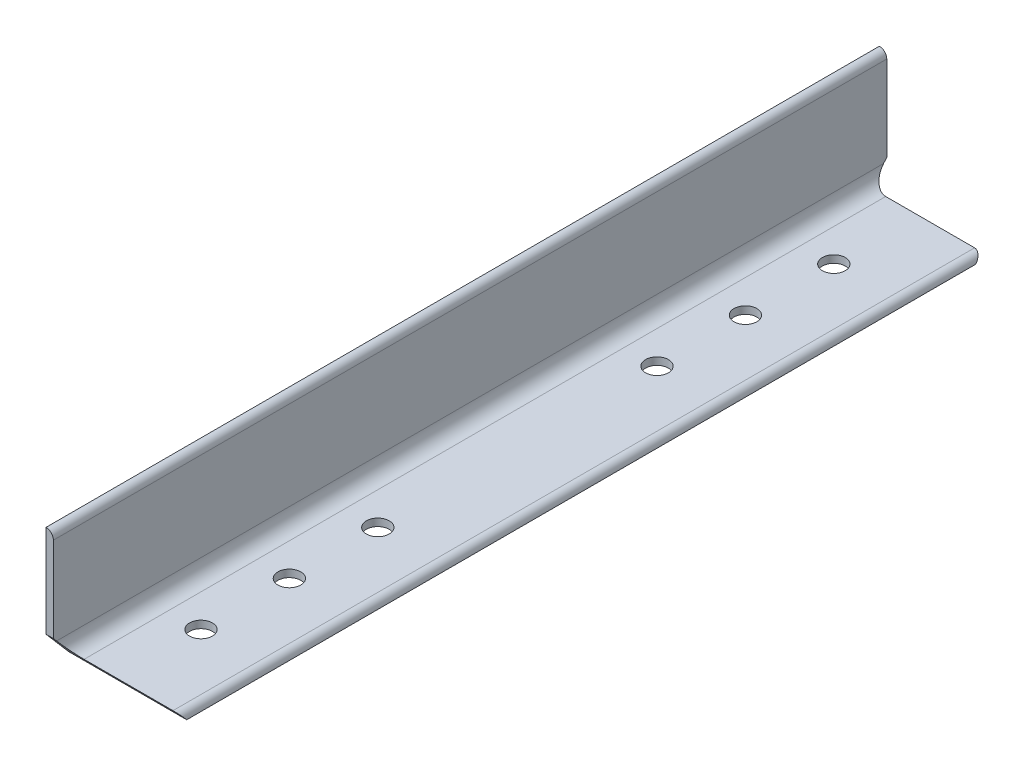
ISO-10303-21;
HEADER;
FILE_DESCRIPTION(('STEP AP214'),'2;1');
FILE_NAME('part.step','',(''),(''),'','','');
FILE_SCHEMA(('AUTOMOTIVE_DESIGN { 1 0 10303 214 1 1 1 1 }'));
ENDSEC;
DATA;
#1=APPLICATION_CONTEXT('core data for automotive mechanical design processes');
#2=APPLICATION_PROTOCOL_DEFINITION('international standard','automotive_design',2000,#1);
#3=PRODUCT_CONTEXT('',#1,'mechanical');
#4=PRODUCT('Part','Part','',(#3));
#5=PRODUCT_RELATED_PRODUCT_CATEGORY('part','',(#4));
#6=PRODUCT_DEFINITION_FORMATION('','',#4);
#7=PRODUCT_DEFINITION_CONTEXT('part definition',#1,'design');
#8=PRODUCT_DEFINITION('design','',#6,#7);
#9=PRODUCT_DEFINITION_SHAPE('','',#8);
#10=(LENGTH_UNIT() NAMED_UNIT(*) SI_UNIT(.MILLI.,.METRE.));
#11=(NAMED_UNIT(*) PLANE_ANGLE_UNIT() SI_UNIT($,.RADIAN.));
#12=(NAMED_UNIT(*) SI_UNIT($,.STERADIAN.) SOLID_ANGLE_UNIT());
#13=UNCERTAINTY_MEASURE_WITH_UNIT(LENGTH_MEASURE(1.E-05),#10,'distance_accuracy_value','');
#14=(GEOMETRIC_REPRESENTATION_CONTEXT(3) GLOBAL_UNCERTAINTY_ASSIGNED_CONTEXT((#13)) GLOBAL_UNIT_ASSIGNED_CONTEXT((#10,
#11,#12)) REPRESENTATION_CONTEXT('',''));
#15=CARTESIAN_POINT('',(0.,0.,0.));
#16=DIRECTION('',(0.,0.,1.));
#17=DIRECTION('',(1.,0.,0.));
#18=AXIS2_PLACEMENT_3D('',#15,#16,#17);
#19=CARTESIAN_POINT('',(37.3445567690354,-13.455443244,357.74569675));
#20=DIRECTION('',(0.,1.,0.));
#21=DIRECTION('',(-1.,0.,0.));
#22=AXIS2_PLACEMENT_3D('',#19,#20,#21);
#23=PLANE('',#22);
#24=CARTESIAN_POINT('',(10.0446367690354,-13.455443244,314.56569675));
#25=DIRECTION('',(0.,1.,0.));
#26=DIRECTION('',(0.,0.,1.));
#27=AXIS2_PLACEMENT_3D('',#24,#25,#26);
#28=CIRCLE('',#27,4.90220000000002);
#29=CARTESIAN_POINT('',(10.0446367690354,-13.455443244,319.46789675));
#30=VERTEX_POINT('',#29);
#31=EDGE_CURVE('E168',#30,#30,#28,.T.);
#32=ORIENTED_EDGE('',*,*,#31,.T.);
#33=EDGE_LOOP('',(#32));
#34=FACE_BOUND('',#33,.T.);
#35=CARTESIAN_POINT('',(10.0446367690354,-13.455443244,119.075199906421));
#36=DIRECTION('',(0.,1.,0.));
#37=DIRECTION('',(0.,0.,1.));
#38=AXIS2_PLACEMENT_3D('',#35,#36,#37);
#39=CIRCLE('',#38,4.90219999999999);
#40=CARTESIAN_POINT('',(10.0446367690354,-13.455443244,123.977399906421));
#41=VERTEX_POINT('',#40);
#42=EDGE_CURVE('E223',#41,#41,#39,.T.);
#43=ORIENTED_EDGE('',*,*,#42,.T.);
#44=EDGE_LOOP('',(#43));
#45=FACE_BOUND('',#44,.T.);
#46=CARTESIAN_POINT('',(10.0446367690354,-13.455443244,81.1757262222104));
#47=DIRECTION('',(0.,1.,0.));
#48=DIRECTION('',(0.,0.,1.));
#49=AXIS2_PLACEMENT_3D('',#46,#47,#48);
#50=CIRCLE('',#49,4.90219999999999);
#51=CARTESIAN_POINT('',(10.0446367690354,-13.455443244,86.0779262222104));
#52=VERTEX_POINT('',#51);
#53=EDGE_CURVE('E194',#52,#52,#50,.T.);
#54=ORIENTED_EDGE('',*,*,#53,.T.);
#55=EDGE_LOOP('',(#54));
#56=FACE_BOUND('',#55,.T.);
#57=CARTESIAN_POINT('',(10.0446367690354,-13.455443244,43.276252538));
#58=DIRECTION('',(0.,1.,0.));
#59=DIRECTION('',(0.,0.,1.));
#60=AXIS2_PLACEMENT_3D('',#57,#58,#59);
#61=CIRCLE('',#60,4.9022);
#62=CARTESIAN_POINT('',(10.0446367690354,-13.455443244,48.178452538));
#63=VERTEX_POINT('',#62);
#64=EDGE_CURVE('E233',#63,#63,#61,.T.);
#65=ORIENTED_EDGE('',*,*,#64,.T.);
#66=EDGE_LOOP('',(#65));
#67=FACE_BOUND('',#66,.T.);
#68=CARTESIAN_POINT('',(10.0446367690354,-13.455443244,238.766749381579));
#69=DIRECTION('',(0.,1.,0.));
#70=DIRECTION('',(0.,0.,1.));
#71=AXIS2_PLACEMENT_3D('',#68,#69,#70);
#72=CIRCLE('',#71,4.90220000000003);
#73=CARTESIAN_POINT('',(10.0446367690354,-13.455443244,243.668949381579));
#74=VERTEX_POINT('',#73);
#75=EDGE_CURVE('E231',#74,#74,#72,.T.);
#76=ORIENTED_EDGE('',*,*,#75,.T.);
#77=EDGE_LOOP('',(#76));
#78=FACE_BOUND('',#77,.T.);
#79=CARTESIAN_POINT('',(10.0446367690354,-13.455443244,276.66622306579));
#80=DIRECTION('',(0.,1.,0.));
#81=DIRECTION('',(0.,0.,1.));
#82=AXIS2_PLACEMENT_3D('',#79,#80,#81);
#83=CIRCLE('',#82,4.90220000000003);
#84=CARTESIAN_POINT('',(10.0446367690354,-13.455443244,281.56842306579));
#85=VERTEX_POINT('',#84);
#86=EDGE_CURVE('E226',#85,#85,#83,.T.);
#87=ORIENTED_EDGE('',*,*,#86,.T.);
#88=EDGE_LOOP('',(#87));
#89=FACE_BOUND('',#88,.T.);
#90=DIRECTION('',(0.,0.,-1.));
#91=VECTOR('',#90,1.);
#92=CARTESIAN_POINT('',(-13.4554432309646,-13.455443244,357.74569675));
#93=LINE('',#92,#91);
#94=CARTESIAN_POINT('',(-13.4554432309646,-13.455443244,347.96669675));
#95=VERTEX_POINT('',#94);
#96=CARTESIAN_POINT('',(-13.4554432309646,-13.455443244,9.77899999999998));
#97=VERTEX_POINT('',#96);
#98=EDGE_CURVE('E181',#95,#97,#93,.T.);
#99=ORIENTED_EDGE('',*,*,#98,.T.);
#100=DIRECTION('',(1.,0.,0.));
#101=VECTOR('',#100,1.);
#102=CARTESIAN_POINT('',(37.3445567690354,-13.455443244,9.77899999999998));
#103=LINE('',#102,#101);
#104=CARTESIAN_POINT('',(37.3445567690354,-13.455443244,9.77899999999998));
#105=VERTEX_POINT('',#104);
#106=EDGE_CURVE('E136',#97,#105,#103,.T.);
#107=ORIENTED_EDGE('',*,*,#106,.T.);
#108=DIRECTION('',(0.,0.,-1.));
#109=VECTOR('',#108,1.);
#110=CARTESIAN_POINT('',(37.3445567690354,-13.455443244,357.74569675));
#111=LINE('',#110,#109);
#112=CARTESIAN_POINT('',(37.3445567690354,-13.455443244,347.96669675));
#113=VERTEX_POINT('',#112);
#114=EDGE_CURVE('E11',#113,#105,#111,.T.);
#115=ORIENTED_EDGE('',*,*,#114,.F.);
#116=DIRECTION('',(-1.,0.,0.));
#117=VECTOR('',#116,1.);
#118=CARTESIAN_POINT('',(37.3445567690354,-13.455443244,347.96669675));
#119=LINE('',#118,#117);
#120=EDGE_CURVE('E464',#113,#95,#119,.T.);
#121=ORIENTED_EDGE('',*,*,#120,.T.);
#122=EDGE_LOOP('',(#99,#107,#115,#121));
#123=FACE_BOUND('',#122,.T.);
#124=ADVANCED_FACE('F35',(#34,#45,#56,#67,#78,#89,#123),#23,.F.);
#125=CARTESIAN_POINT('',(37.3445567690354,-13.450363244,357.74569675));
#126=DIRECTION('',(-1.,0.,0.));
#127=DIRECTION('',(0.,0.,1.));
#128=AXIS2_PLACEMENT_3D('',#125,#126,#127);
#129=PLANE('',#128);
#130=ORIENTED_EDGE('',*,*,#114,.T.);
#131=DIRECTION('',(0.,-1.,0.));
#132=VECTOR('',#131,1.);
#133=CARTESIAN_POINT('',(37.3445567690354,-31.3929101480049,9.779));
#134=LINE('',#133,#132);
#135=CARTESIAN_POINT('',(37.3445567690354,-13.450363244,9.77899999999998));
#136=VERTEX_POINT('',#135);
#137=EDGE_CURVE('E141',#136,#105,#134,.T.);
#138=ORIENTED_EDGE('',*,*,#137,.F.);
#139=DIRECTION('',(0.,0.,-1.));
#140=VECTOR('',#139,1.);
#141=CARTESIAN_POINT('',(37.3445567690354,-13.450363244,357.74569675));
#142=LINE('',#141,#140);
#143=CARTESIAN_POINT('',(37.3445567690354,-13.450363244,347.96669675));
#144=VERTEX_POINT('',#143);
#145=EDGE_CURVE('E43',#144,#136,#142,.T.);
#146=ORIENTED_EDGE('',*,*,#145,.F.);
#147=DIRECTION('',(0.,1.,0.));
#148=VECTOR('',#147,1.);
#149=CARTESIAN_POINT('',(37.3445567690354,-24.0856653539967,347.96669675));
#150=LINE('',#149,#148);
#151=EDGE_CURVE('E497',#113,#144,#150,.T.);
#152=ORIENTED_EDGE('',*,*,#151,.F.);
#153=EDGE_LOOP('',(#130,#138,#146,#152));
#154=FACE_BOUND('',#153,.T.);
#155=ADVANCED_FACE('F149',(#154),#129,.F.);
#156=CARTESIAN_POINT('',(34.1746367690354,-13.450363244,357.74569675));
#157=DIRECTION('',(0.,0.,-1.));
#158=DIRECTION('',(-1.,0.,0.));
#159=AXIS2_PLACEMENT_3D('',#156,#157,#158);
#160=CYLINDRICAL_SURFACE('',#159,3.16992);
#161=ORIENTED_EDGE('',*,*,#145,.T.);
#162=CARTESIAN_POINT('',(34.1746367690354,-13.450363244,9.77899999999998));
#163=DIRECTION('',(0.,0.650962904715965,0.759109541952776));
#164=DIRECTION('',(0.,0.759109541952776,-0.650962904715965));
#165=AXIS2_PLACEMENT_3D('',#162,#163,#164);
#166=ELLIPSE('',#165,4.17584001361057,3.16992);
#167=CARTESIAN_POINT('',(34.1746367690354,-10.280443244,7.06068305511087));
#168=VERTEX_POINT('',#167);
#169=EDGE_CURVE('E125',#136,#168,#166,.T.);
#170=ORIENTED_EDGE('',*,*,#169,.T.);
#171=DIRECTION('',(0.,0.,-1.));
#172=VECTOR('',#171,1.);
#173=CARTESIAN_POINT('',(34.1746367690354,-10.280443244,357.74569675));
#174=LINE('',#173,#172);
#175=CARTESIAN_POINT('',(34.1746367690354,-10.280443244,350.685013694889));
#176=VERTEX_POINT('',#175);
#177=EDGE_CURVE('E158',#176,#168,#174,.T.);
#178=ORIENTED_EDGE('',*,*,#177,.F.);
#179=CARTESIAN_POINT('',(34.1746367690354,-13.450363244,347.96669675));
#180=DIRECTION('',(0.,0.650962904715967,-0.759109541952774));
#181=DIRECTION('',(0.,-0.759109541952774,-0.650962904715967));
#182=AXIS2_PLACEMENT_3D('',#179,#180,#181);
#183=ELLIPSE('',#182,4.17584001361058,3.16992);
#184=EDGE_CURVE('E157',#176,#144,#183,.T.);
#185=ORIENTED_EDGE('',*,*,#184,.T.);
#186=EDGE_LOOP('',(#161,#170,#178,#185));
#187=FACE_BOUND('',#186,.T.);
#188=ADVANCED_FACE('F156',(#187),#160,.T.);
#189=CARTESIAN_POINT('',(-3.93044323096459,-10.280443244,357.74569675));
#190=DIRECTION('',(0.,-1.,0.));
#191=DIRECTION('',(0.,0.,-1.));
#192=AXIS2_PLACEMENT_3D('',#189,#190,#191);
#193=PLANE('',#192);
#194=CARTESIAN_POINT('',(10.0446367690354,-10.280443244,314.56569675));
#195=DIRECTION('',(0.,-1.,0.));
#196=DIRECTION('',(0.,0.,-1.));
#197=AXIS2_PLACEMENT_3D('',#194,#195,#196);
#198=CIRCLE('',#197,4.90220000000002);
#199=CARTESIAN_POINT('',(10.0446367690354,-10.280443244,309.66349675));
#200=VERTEX_POINT('',#199);
#201=EDGE_CURVE('E38',#200,#200,#198,.T.);
#202=ORIENTED_EDGE('',*,*,#201,.T.);
#203=EDGE_LOOP('',(#202));
#204=FACE_BOUND('',#203,.T.);
#205=CARTESIAN_POINT('',(10.0446367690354,-10.280443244,119.075199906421));
#206=DIRECTION('',(0.,-1.,0.));
#207=DIRECTION('',(0.,0.,-1.));
#208=AXIS2_PLACEMENT_3D('',#205,#206,#207);
#209=CIRCLE('',#208,4.90219999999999);
#210=CARTESIAN_POINT('',(10.0446367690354,-10.280443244,114.172999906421));
#211=VERTEX_POINT('',#210);
#212=EDGE_CURVE('E176',#211,#211,#209,.T.);
#213=ORIENTED_EDGE('',*,*,#212,.T.);
#214=EDGE_LOOP('',(#213));
#215=FACE_BOUND('',#214,.T.);
#216=CARTESIAN_POINT('',(10.0446367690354,-10.280443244,81.1757262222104));
#217=DIRECTION('',(0.,-1.,0.));
#218=DIRECTION('',(0.,0.,-1.));
#219=AXIS2_PLACEMENT_3D('',#216,#217,#218);
#220=CIRCLE('',#219,4.90219999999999);
#221=CARTESIAN_POINT('',(10.0446367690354,-10.280443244,76.2735262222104));
#222=VERTEX_POINT('',#221);
#223=EDGE_CURVE('E174',#222,#222,#220,.T.);
#224=ORIENTED_EDGE('',*,*,#223,.T.);
#225=EDGE_LOOP('',(#224));
#226=FACE_BOUND('',#225,.T.);
#227=CARTESIAN_POINT('',(10.0446367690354,-10.280443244,43.276252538));
#228=DIRECTION('',(0.,-1.,0.));
#229=DIRECTION('',(0.,0.,-1.));
#230=AXIS2_PLACEMENT_3D('',#227,#228,#229);
#231=CIRCLE('',#230,4.9022);
#232=CARTESIAN_POINT('',(10.0446367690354,-10.280443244,38.374052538));
#233=VERTEX_POINT('',#232);
#234=EDGE_CURVE('E171',#233,#233,#231,.T.);
#235=ORIENTED_EDGE('',*,*,#234,.T.);
#236=EDGE_LOOP('',(#235));
#237=FACE_BOUND('',#236,.T.);
#238=CARTESIAN_POINT('',(10.0446367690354,-10.280443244,238.766749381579));
#239=DIRECTION('',(0.,-1.,0.));
#240=DIRECTION('',(0.,0.,-1.));
#241=AXIS2_PLACEMENT_3D('',#238,#239,#240);
#242=CIRCLE('',#241,4.90220000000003);
#243=CARTESIAN_POINT('',(10.0446367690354,-10.280443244,233.864549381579));
#244=VERTEX_POINT('',#243);
#245=EDGE_CURVE('E167',#244,#244,#242,.T.);
#246=ORIENTED_EDGE('',*,*,#245,.T.);
#247=EDGE_LOOP('',(#246));
#248=FACE_BOUND('',#247,.T.);
#249=CARTESIAN_POINT('',(10.0446367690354,-10.280443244,276.66622306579));
#250=DIRECTION('',(0.,-1.,0.));
#251=DIRECTION('',(0.,0.,-1.));
#252=AXIS2_PLACEMENT_3D('',#249,#250,#251);
#253=CIRCLE('',#252,4.90220000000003);
#254=CARTESIAN_POINT('',(10.0446367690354,-10.280443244,271.76402306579));
#255=VERTEX_POINT('',#254);
#256=EDGE_CURVE('E164',#255,#255,#253,.T.);
#257=ORIENTED_EDGE('',*,*,#256,.T.);
#258=EDGE_LOOP('',(#257));
#259=FACE_BOUND('',#258,.T.);
#260=ORIENTED_EDGE('',*,*,#177,.T.);
#261=DIRECTION('',(-1.,0.,0.));
#262=VECTOR('',#261,1.);
#263=CARTESIAN_POINT('',(-3.93044323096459,-10.280443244,7.06068305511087));
#264=LINE('',#263,#262);
#265=CARTESIAN_POINT('',(-3.93044323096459,-10.280443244,7.06068305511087));
#266=VERTEX_POINT('',#265);
#267=EDGE_CURVE('E131',#168,#266,#264,.T.);
#268=ORIENTED_EDGE('',*,*,#267,.T.);
#269=DIRECTION('',(0.,0.,-1.));
#270=VECTOR('',#269,1.);
#271=CARTESIAN_POINT('',(-3.93044323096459,-10.280443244,357.74569675));
#272=LINE('',#271,#270);
#273=CARTESIAN_POINT('',(-3.93044323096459,-10.280443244,350.685013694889));
#274=VERTEX_POINT('',#273);
#275=EDGE_CURVE('E160',#274,#266,#272,.T.);
#276=ORIENTED_EDGE('',*,*,#275,.F.);
#277=DIRECTION('',(1.,0.,0.));
#278=VECTOR('',#277,1.);
#279=CARTESIAN_POINT('',(-3.93044323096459,-10.280443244,350.685013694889));
#280=LINE('',#279,#278);
#281=EDGE_CURVE('E216',#274,#176,#280,.T.);
#282=ORIENTED_EDGE('',*,*,#281,.T.);
#283=EDGE_LOOP('',(#260,#268,#276,#282));
#284=FACE_BOUND('',#283,.T.);
#285=ADVANCED_FACE('F215',(#204,#215,#226,#237,#248,#259,#284),#193,.F.);
#286=CARTESIAN_POINT('',(-3.93044323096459,-3.930443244,357.74569675));
#287=DIRECTION('',(0.,0.,-1.));
#288=DIRECTION('',(-1.,0.,0.));
#289=AXIS2_PLACEMENT_3D('',#286,#287,#288);
#290=CYLINDRICAL_SURFACE('',#289,6.35);
#291=ORIENTED_EDGE('',*,*,#275,.T.);
#292=CARTESIAN_POINT('',(-3.93044323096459,-3.930443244,1.61533661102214));
#293=DIRECTION('',(0.,0.650962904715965,0.759109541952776));
#294=DIRECTION('',(0.,0.759109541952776,-0.650962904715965));
#295=AXIS2_PLACEMENT_3D('',#292,#293,#294);
#296=ELLIPSE('',#295,8.36506412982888,6.35);
#297=CARTESIAN_POINT('',(-10.2804432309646,-3.93044324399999,1.61533661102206));
#298=VERTEX_POINT('',#297);
#299=EDGE_CURVE('E211',#266,#298,#296,.F.);
#300=ORIENTED_EDGE('',*,*,#299,.T.);
#301=DIRECTION('',(0.,0.,-1.));
#302=VECTOR('',#301,1.);
#303=CARTESIAN_POINT('',(-10.2804432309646,-3.930443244,357.74569675));
#304=LINE('',#303,#302);
#305=CARTESIAN_POINT('',(-10.2804432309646,-3.930443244,356.130360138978));
#306=VERTEX_POINT('',#305);
#307=EDGE_CURVE('E202',#306,#298,#304,.T.);
#308=ORIENTED_EDGE('',*,*,#307,.F.);
#309=CARTESIAN_POINT('',(-3.93044323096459,-3.930443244,356.130360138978));
#310=DIRECTION('',(0.,0.650962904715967,-0.759109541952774));
#311=DIRECTION('',(0.,-0.759109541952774,-0.650962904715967));
#312=AXIS2_PLACEMENT_3D('',#309,#310,#311);
#313=ELLIPSE('',#312,8.3650641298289,6.35);
#314=EDGE_CURVE('E212',#306,#274,#313,.F.);
#315=ORIENTED_EDGE('',*,*,#314,.T.);
#316=EDGE_LOOP('',(#291,#300,#308,#315));
#317=FACE_BOUND('',#316,.T.);
#318=ADVANCED_FACE('F209',(#317),#290,.F.);
#319=CARTESIAN_POINT('',(-10.2804432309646,34.174636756,357.74569675));
#320=DIRECTION('',(-1.,0.,0.));
#321=DIRECTION('',(0.,-1.,0.));
#322=AXIS2_PLACEMENT_3D('',#319,#320,#321);
#323=PLANE('',#322);
#324=ORIENTED_EDGE('',*,*,#307,.T.);
#325=DIRECTION('',(0.,0.759109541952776,-0.650962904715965));
#326=VECTOR('',#325,1.);
#327=CARTESIAN_POINT('',(-10.2804432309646,-157.955077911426,133.696832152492));
#328=LINE('',#327,#326);
#329=CARTESIAN_POINT('',(-10.2804432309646,-2.342943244,0.253999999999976));
#330=VERTEX_POINT('',#329);
#331=EDGE_CURVE('E218',#298,#330,#328,.T.);
#332=ORIENTED_EDGE('',*,*,#331,.T.);
#333=DIRECTION('',(0.,1.,0.));
#334=VECTOR('',#333,1.);
#335=CARTESIAN_POINT('',(-10.2804432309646,34.1746367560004,0.254000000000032));
#336=LINE('',#335,#334);
#337=CARTESIAN_POINT('',(-10.2804432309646,34.174636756,0.254000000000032));
#338=VERTEX_POINT('',#337);
#339=EDGE_CURVE('E478',#330,#338,#336,.T.);
#340=ORIENTED_EDGE('',*,*,#339,.T.);
#341=DIRECTION('',(0.,0.,-1.));
#342=VECTOR('',#341,1.);
#343=CARTESIAN_POINT('',(-10.2804432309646,34.174636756,357.74569675));
#344=LINE('',#343,#342);
#345=CARTESIAN_POINT('',(-10.2804432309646,34.174636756,357.49169675));
#346=VERTEX_POINT('',#345);
#347=EDGE_CURVE('E199',#346,#338,#344,.T.);
#348=ORIENTED_EDGE('',*,*,#347,.F.);
#349=DIRECTION('',(0.,-1.,0.));
#350=VECTOR('',#349,1.);
#351=CARTESIAN_POINT('',(-10.2804432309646,34.174636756,357.49169675));
#352=LINE('',#351,#350);
#353=CARTESIAN_POINT('',(-10.2804432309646,-2.342943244,357.49169675));
#354=VERTEX_POINT('',#353);
#355=EDGE_CURVE('E462',#346,#354,#352,.T.);
#356=ORIENTED_EDGE('',*,*,#355,.T.);
#357=DIRECTION('',(0.,-0.759109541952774,-0.650962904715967));
#358=VECTOR('',#357,1.);
#359=CARTESIAN_POINT('',(-10.2804432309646,18.8257281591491,375.644570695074));
#360=LINE('',#359,#358);
#361=EDGE_CURVE('E460',#354,#306,#360,.T.);
#362=ORIENTED_EDGE('',*,*,#361,.T.);
#363=EDGE_LOOP('',(#324,#332,#340,#348,#356,#362));
#364=FACE_BOUND('',#363,.T.);
#365=ADVANCED_FACE('F376',(#364),#323,.F.);
#366=CARTESIAN_POINT('',(-13.4503632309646,34.174636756,357.74569675));
#367=DIRECTION('',(0.,0.,-1.));
#368=DIRECTION('',(-1.,0.,0.));
#369=AXIS2_PLACEMENT_3D('',#366,#367,#368);
#370=CYLINDRICAL_SURFACE('',#369,3.16992);
#371=ORIENTED_EDGE('',*,*,#347,.T.);
#372=CARTESIAN_POINT('',(-13.4503632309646,34.174636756,0.254000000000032));
#373=DIRECTION('',(0.,0.,1.));
#374=DIRECTION('',(0.,-1.,0.));
#375=AXIS2_PLACEMENT_3D('',#372,#373,#374);
#376=CIRCLE('',#375,3.16992);
#377=CARTESIAN_POINT('',(-13.4503632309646,37.344556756,0.254000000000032));
#378=VERTEX_POINT('',#377);
#379=EDGE_CURVE('E475',#338,#378,#376,.T.);
#380=ORIENTED_EDGE('',*,*,#379,.T.);
#381=DIRECTION('',(0.,0.,-1.));
#382=VECTOR('',#381,1.);
#383=CARTESIAN_POINT('',(-13.4503632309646,37.344556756,357.74569675));
#384=LINE('',#383,#382);
#385=CARTESIAN_POINT('',(-13.4503632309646,37.344556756,357.49169675));
#386=VERTEX_POINT('',#385);
#387=EDGE_CURVE('E191',#386,#378,#384,.T.);
#388=ORIENTED_EDGE('',*,*,#387,.F.);
#389=CARTESIAN_POINT('',(-13.4503632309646,34.174636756,357.49169675));
#390=DIRECTION('',(0.,0.,-1.));
#391=DIRECTION('',(-1.,0.,0.));
#392=AXIS2_PLACEMENT_3D('',#389,#390,#391);
#393=CIRCLE('',#392,3.16992);
#394=EDGE_CURVE('E481',#386,#346,#393,.T.);
#395=ORIENTED_EDGE('',*,*,#394,.T.);
#396=EDGE_LOOP('',(#371,#380,#388,#395));
#397=FACE_BOUND('',#396,.T.);
#398=ADVANCED_FACE('F366',(#397),#370,.T.);
#399=CARTESIAN_POINT('',(-13.4554432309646,37.344556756,357.74569675));
#400=DIRECTION('',(1.36592399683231E-12,-1.,0.));
#401=DIRECTION('',(1.,1.36592399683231E-12,0.));
#402=AXIS2_PLACEMENT_3D('',#399,#400,#401);
#403=PLANE('',#402);
#404=ORIENTED_EDGE('',*,*,#387,.T.);
#405=DIRECTION('',(-1.,-1.36592399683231E-12,0.));
#406=VECTOR('',#405,1.);
#407=CARTESIAN_POINT('',(-13.4554432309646,37.344556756,0.254000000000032));
#408=LINE('',#407,#406);
#409=CARTESIAN_POINT('',(-13.4554432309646,37.344556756,0.253999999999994));
#410=VERTEX_POINT('',#409);
#411=EDGE_CURVE('E472',#378,#410,#408,.T.);
#412=ORIENTED_EDGE('',*,*,#411,.T.);
#413=DIRECTION('',(0.,0.,-1.));
#414=VECTOR('',#413,1.);
#415=CARTESIAN_POINT('',(-13.4554432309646,37.344556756,357.74569675));
#416=LINE('',#415,#414);
#417=CARTESIAN_POINT('',(-13.4554432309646,37.344556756,357.49169675));
#418=VERTEX_POINT('',#417);
#419=EDGE_CURVE('E185',#418,#410,#416,.T.);
#420=ORIENTED_EDGE('',*,*,#419,.F.);
#421=DIRECTION('',(1.,1.36592399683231E-12,0.));
#422=VECTOR('',#421,1.);
#423=CARTESIAN_POINT('',(-13.4554432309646,37.344556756,357.49169675));
#424=LINE('',#423,#422);
#425=EDGE_CURVE('E59',#418,#386,#424,.T.);
#426=ORIENTED_EDGE('',*,*,#425,.T.);
#427=EDGE_LOOP('',(#404,#412,#420,#426));
#428=FACE_BOUND('',#427,.T.);
#429=ADVANCED_FACE('F270',(#428),#403,.F.);
#430=CARTESIAN_POINT('',(-13.4554432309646,-13.455443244,357.74569675));
#431=DIRECTION('',(1.,0.,0.));
#432=DIRECTION('',(0.,1.,0.));
#433=AXIS2_PLACEMENT_3D('',#430,#431,#432);
#434=PLANE('',#433);
#435=DIRECTION('',(0.,-0.759109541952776,0.650962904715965));
#436=VECTOR('',#435,1.);
#437=CARTESIAN_POINT('',(-13.4554432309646,-13.450363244,9.77899999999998));
#438=LINE('',#437,#436);
#439=CARTESIAN_POINT('',(-13.4554432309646,-2.342943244,0.25399999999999));
#440=VERTEX_POINT('',#439);
#441=CARTESIAN_POINT('',(-13.4554432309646,-13.450363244,9.77899999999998));
#442=VERTEX_POINT('',#441);
#443=EDGE_CURVE('E51',#440,#442,#438,.T.);
#444=ORIENTED_EDGE('',*,*,#443,.T.);
#445=DIRECTION('',(0.,-1.,0.));
#446=VECTOR('',#445,1.);
#447=CARTESIAN_POINT('',(-13.4554432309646,-31.3929101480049,9.779));
#448=LINE('',#447,#446);
#449=EDGE_CURVE('E144',#442,#97,#448,.T.);
#450=ORIENTED_EDGE('',*,*,#449,.T.);
#451=ORIENTED_EDGE('',*,*,#98,.F.);
#452=DIRECTION('',(0.,1.,0.));
#453=VECTOR('',#452,1.);
#454=CARTESIAN_POINT('',(-13.4554432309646,-24.0856653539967,347.96669675));
#455=LINE('',#454,#453);
#456=CARTESIAN_POINT('',(-13.4554432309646,-13.450363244,347.96669675));
#457=VERTEX_POINT('',#456);
#458=EDGE_CURVE('E492',#95,#457,#455,.T.);
#459=ORIENTED_EDGE('',*,*,#458,.T.);
#460=DIRECTION('',(0.,0.759109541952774,0.650962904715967));
#461=VECTOR('',#460,1.);
#462=CARTESIAN_POINT('',(-13.4554432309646,-13.450363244,347.96669675));
#463=LINE('',#462,#461);
#464=CARTESIAN_POINT('',(-13.4554432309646,-2.342943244,357.49169675));
#465=VERTEX_POINT('',#464);
#466=EDGE_CURVE('E488',#457,#465,#463,.T.);
#467=ORIENTED_EDGE('',*,*,#466,.T.);
#468=DIRECTION('',(0.,1.,0.));
#469=VECTOR('',#468,1.);
#470=CARTESIAN_POINT('',(-13.4554432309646,-2.342943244,357.49169675));
#471=LINE('',#470,#469);
#472=EDGE_CURVE('E495',#465,#418,#471,.T.);
#473=ORIENTED_EDGE('',*,*,#472,.T.);
#474=ORIENTED_EDGE('',*,*,#419,.T.);
#475=DIRECTION('',(0.,-1.,0.));
#476=VECTOR('',#475,1.);
#477=CARTESIAN_POINT('',(-13.4554432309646,11.944556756,0.253999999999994));
#478=LINE('',#477,#476);
#479=EDGE_CURVE('E152',#410,#440,#478,.T.);
#480=ORIENTED_EDGE('',*,*,#479,.T.);
#481=EDGE_LOOP('',(#444,#450,#451,#459,#467,#473,#474,#480));
#482=FACE_BOUND('',#481,.T.);
#483=ADVANCED_FACE('F261',(#482),#434,.F.);
#484=CARTESIAN_POINT('',(10.0446367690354,-13.455443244,276.66622306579));
#485=DIRECTION('',(0.,1.,0.));
#486=DIRECTION('',(0.,0.,1.));
#487=AXIS2_PLACEMENT_3D('',#484,#485,#486);
#488=CYLINDRICAL_SURFACE('',#487,4.90220000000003);
#489=ORIENTED_EDGE('',*,*,#86,.F.);
#490=EDGE_LOOP('',(#489));
#491=FACE_BOUND('',#490,.T.);
#492=ORIENTED_EDGE('',*,*,#256,.F.);
#493=EDGE_LOOP('',(#492));
#494=FACE_BOUND('',#493,.T.);
#495=ADVANCED_FACE('F258',(#491,#494),#488,.F.);
#496=CARTESIAN_POINT('',(10.0446367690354,-13.455443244,238.766749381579));
#497=DIRECTION('',(0.,1.,0.));
#498=DIRECTION('',(0.,0.,1.));
#499=AXIS2_PLACEMENT_3D('',#496,#497,#498);
#500=CYLINDRICAL_SURFACE('',#499,4.90220000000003);
#501=ORIENTED_EDGE('',*,*,#75,.F.);
#502=EDGE_LOOP('',(#501));
#503=FACE_BOUND('',#502,.T.);
#504=ORIENTED_EDGE('',*,*,#245,.F.);
#505=EDGE_LOOP('',(#504));
#506=FACE_BOUND('',#505,.T.);
#507=ADVANCED_FACE('F260',(#503,#506),#500,.F.);
#508=CARTESIAN_POINT('',(10.0446367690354,-13.455443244,43.276252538));
#509=DIRECTION('',(0.,1.,0.));
#510=DIRECTION('',(0.,0.,1.));
#511=AXIS2_PLACEMENT_3D('',#508,#509,#510);
#512=CYLINDRICAL_SURFACE('',#511,4.9022);
#513=ORIENTED_EDGE('',*,*,#64,.F.);
#514=EDGE_LOOP('',(#513));
#515=FACE_BOUND('',#514,.T.);
#516=ORIENTED_EDGE('',*,*,#234,.F.);
#517=EDGE_LOOP('',(#516));
#518=FACE_BOUND('',#517,.T.);
#519=ADVANCED_FACE('F245',(#515,#518),#512,.F.);
#520=CARTESIAN_POINT('',(10.0446367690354,-13.455443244,81.1757262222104));
#521=DIRECTION('',(0.,1.,0.));
#522=DIRECTION('',(0.,0.,1.));
#523=AXIS2_PLACEMENT_3D('',#520,#521,#522);
#524=CYLINDRICAL_SURFACE('',#523,4.90219999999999);
#525=ORIENTED_EDGE('',*,*,#53,.F.);
#526=EDGE_LOOP('',(#525));
#527=FACE_BOUND('',#526,.T.);
#528=ORIENTED_EDGE('',*,*,#223,.F.);
#529=EDGE_LOOP('',(#528));
#530=FACE_BOUND('',#529,.T.);
#531=ADVANCED_FACE('F241',(#527,#530),#524,.F.);
#532=CARTESIAN_POINT('',(10.0446367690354,-13.455443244,119.075199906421));
#533=DIRECTION('',(0.,1.,0.));
#534=DIRECTION('',(0.,0.,1.));
#535=AXIS2_PLACEMENT_3D('',#532,#533,#534);
#536=CYLINDRICAL_SURFACE('',#535,4.90219999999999);
#537=ORIENTED_EDGE('',*,*,#42,.F.);
#538=EDGE_LOOP('',(#537));
#539=FACE_BOUND('',#538,.T.);
#540=ORIENTED_EDGE('',*,*,#212,.F.);
#541=EDGE_LOOP('',(#540));
#542=FACE_BOUND('',#541,.T.);
#543=ADVANCED_FACE('F244',(#539,#542),#536,.F.);
#544=CARTESIAN_POINT('',(10.0446367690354,-13.455443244,314.56569675));
#545=DIRECTION('',(0.,1.,0.));
#546=DIRECTION('',(0.,0.,1.));
#547=AXIS2_PLACEMENT_3D('',#544,#545,#546);
#548=CYLINDRICAL_SURFACE('',#547,4.90220000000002);
#549=ORIENTED_EDGE('',*,*,#31,.F.);
#550=EDGE_LOOP('',(#549));
#551=FACE_BOUND('',#550,.T.);
#552=ORIENTED_EDGE('',*,*,#201,.F.);
#553=EDGE_LOOP('',(#552));
#554=FACE_BOUND('',#553,.T.);
#555=ADVANCED_FACE('F286',(#551,#554),#548,.F.);
#556=CARTESIAN_POINT('',(-13.4554432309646,-13.450363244,347.96669675));
#557=DIRECTION('',(0.,0.650962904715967,-0.759109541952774));
#558=DIRECTION('',(0.,0.759109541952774,0.650962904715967));
#559=AXIS2_PLACEMENT_3D('',#556,#557,#558);
#560=PLANE('',#559);
#561=ORIENTED_EDGE('',*,*,#281,.F.);
#562=ORIENTED_EDGE('',*,*,#314,.F.);
#563=ORIENTED_EDGE('',*,*,#361,.F.);
#564=DIRECTION('',(1.,0.,0.));
#565=VECTOR('',#564,1.);
#566=CARTESIAN_POINT('',(-13.4554432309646,-2.342943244,357.49169675));
#567=LINE('',#566,#565);
#568=EDGE_CURVE('E153',#465,#354,#567,.T.);
#569=ORIENTED_EDGE('',*,*,#568,.F.);
#570=ORIENTED_EDGE('',*,*,#466,.F.);
#571=DIRECTION('',(1.,0.,0.));
#572=VECTOR('',#571,1.);
#573=CARTESIAN_POINT('',(-13.4554432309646,-13.450363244,347.96669675));
#574=LINE('',#573,#572);
#575=EDGE_CURVE('E485',#457,#144,#574,.T.);
#576=ORIENTED_EDGE('',*,*,#575,.T.);
#577=ORIENTED_EDGE('',*,*,#184,.F.);
#578=EDGE_LOOP('',(#561,#562,#563,#569,#570,#576,#577));
#579=FACE_BOUND('',#578,.T.);
#580=ADVANCED_FACE('F290',(#579),#560,.F.);
#581=CARTESIAN_POINT('',(-13.4554432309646,-24.0856653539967,347.96669675));
#582=DIRECTION('',(0.,0.,-1.));
#583=DIRECTION('',(-1.,0.,0.));
#584=AXIS2_PLACEMENT_3D('',#581,#582,#583);
#585=PLANE('',#584);
#586=ORIENTED_EDGE('',*,*,#151,.T.);
#587=ORIENTED_EDGE('',*,*,#575,.F.);
#588=ORIENTED_EDGE('',*,*,#458,.F.);
#589=ORIENTED_EDGE('',*,*,#120,.F.);
#590=EDGE_LOOP('',(#586,#587,#588,#589));
#591=FACE_BOUND('',#590,.T.);
#592=ADVANCED_FACE('F297',(#591),#585,.F.);
#593=CARTESIAN_POINT('',(-13.4554432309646,11.9445567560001,357.49169675));
#594=DIRECTION('',(0.,0.,-1.));
#595=DIRECTION('',(-1.,0.,0.));
#596=AXIS2_PLACEMENT_3D('',#593,#594,#595);
#597=PLANE('',#596);
#598=ORIENTED_EDGE('',*,*,#394,.F.);
#599=ORIENTED_EDGE('',*,*,#425,.F.);
#600=ORIENTED_EDGE('',*,*,#472,.F.);
#601=ORIENTED_EDGE('',*,*,#568,.T.);
#602=ORIENTED_EDGE('',*,*,#355,.F.);
#603=EDGE_LOOP('',(#598,#599,#600,#601,#602));
#604=FACE_BOUND('',#603,.T.);
#605=ADVANCED_FACE('F294',(#604),#597,.F.);
#606=CARTESIAN_POINT('',(-13.4554432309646,-31.3929101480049,9.779));
#607=DIRECTION('',(0.,0.,1.));
#608=DIRECTION('',(0.,-1.,0.));
#609=AXIS2_PLACEMENT_3D('',#606,#607,#608);
#610=PLANE('',#609);
#611=ORIENTED_EDGE('',*,*,#449,.F.);
#612=DIRECTION('',(1.,0.,0.));
#613=VECTOR('',#612,1.);
#614=CARTESIAN_POINT('',(-13.4554432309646,-13.450363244,9.77899999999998));
#615=LINE('',#614,#613);
#616=EDGE_CURVE('E128',#442,#136,#615,.T.);
#617=ORIENTED_EDGE('',*,*,#616,.T.);
#618=ORIENTED_EDGE('',*,*,#137,.T.);
#619=ORIENTED_EDGE('',*,*,#106,.F.);
#620=EDGE_LOOP('',(#611,#617,#618,#619));
#621=FACE_BOUND('',#620,.T.);
#622=ADVANCED_FACE('F140',(#621),#610,.F.);
#623=CARTESIAN_POINT('',(-13.4554432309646,-13.450363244,9.77899999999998));
#624=DIRECTION('',(0.,0.650962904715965,0.759109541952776));
#625=DIRECTION('',(0.,-0.759109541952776,0.650962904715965));
#626=AXIS2_PLACEMENT_3D('',#623,#624,#625);
#627=PLANE('',#626);
#628=ORIENTED_EDGE('',*,*,#616,.F.);
#629=ORIENTED_EDGE('',*,*,#443,.F.);
#630=DIRECTION('',(1.,0.,0.));
#631=VECTOR('',#630,1.);
#632=CARTESIAN_POINT('',(-13.4554432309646,-2.342943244,0.253999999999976));
#633=LINE('',#632,#631);
#634=EDGE_CURVE('E145',#440,#330,#633,.T.);
#635=ORIENTED_EDGE('',*,*,#634,.T.);
#636=ORIENTED_EDGE('',*,*,#331,.F.);
#637=ORIENTED_EDGE('',*,*,#299,.F.);
#638=ORIENTED_EDGE('',*,*,#267,.F.);
#639=ORIENTED_EDGE('',*,*,#169,.F.);
#640=EDGE_LOOP('',(#628,#629,#635,#636,#637,#638,#639));
#641=FACE_BOUND('',#640,.T.);
#642=ADVANCED_FACE('F127',(#641),#627,.F.);
#643=CARTESIAN_POINT('',(-13.4554432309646,-2.342943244,0.253999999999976));
#644=DIRECTION('',(0.,0.,1.));
#645=DIRECTION('',(0.,-1.,0.));
#646=AXIS2_PLACEMENT_3D('',#643,#644,#645);
#647=PLANE('',#646);
#648=ORIENTED_EDGE('',*,*,#634,.F.);
#649=ORIENTED_EDGE('',*,*,#479,.F.);
#650=ORIENTED_EDGE('',*,*,#411,.F.);
#651=ORIENTED_EDGE('',*,*,#379,.F.);
#652=ORIENTED_EDGE('',*,*,#339,.F.);
#653=EDGE_LOOP('',(#648,#649,#650,#651,#652));
#654=FACE_BOUND('',#653,.T.);
#655=ADVANCED_FACE('F304',(#654),#647,.F.);
#656=CLOSED_SHELL('',(#124,#155,#188,#285,#318,#365,#398,#429,#483,#495,#507,#519,#531,#543,
#555,#580,#592,#605,#622,#642,#655));
#657=MANIFOLD_SOLID_BREP('B2',#656);
#658=ADVANCED_BREP_SHAPE_REPRESENTATION('',(#18,#657),#14);
#659=SHAPE_DEFINITION_REPRESENTATION(#9,#658);
ENDSEC;
END-ISO-10303-21;
